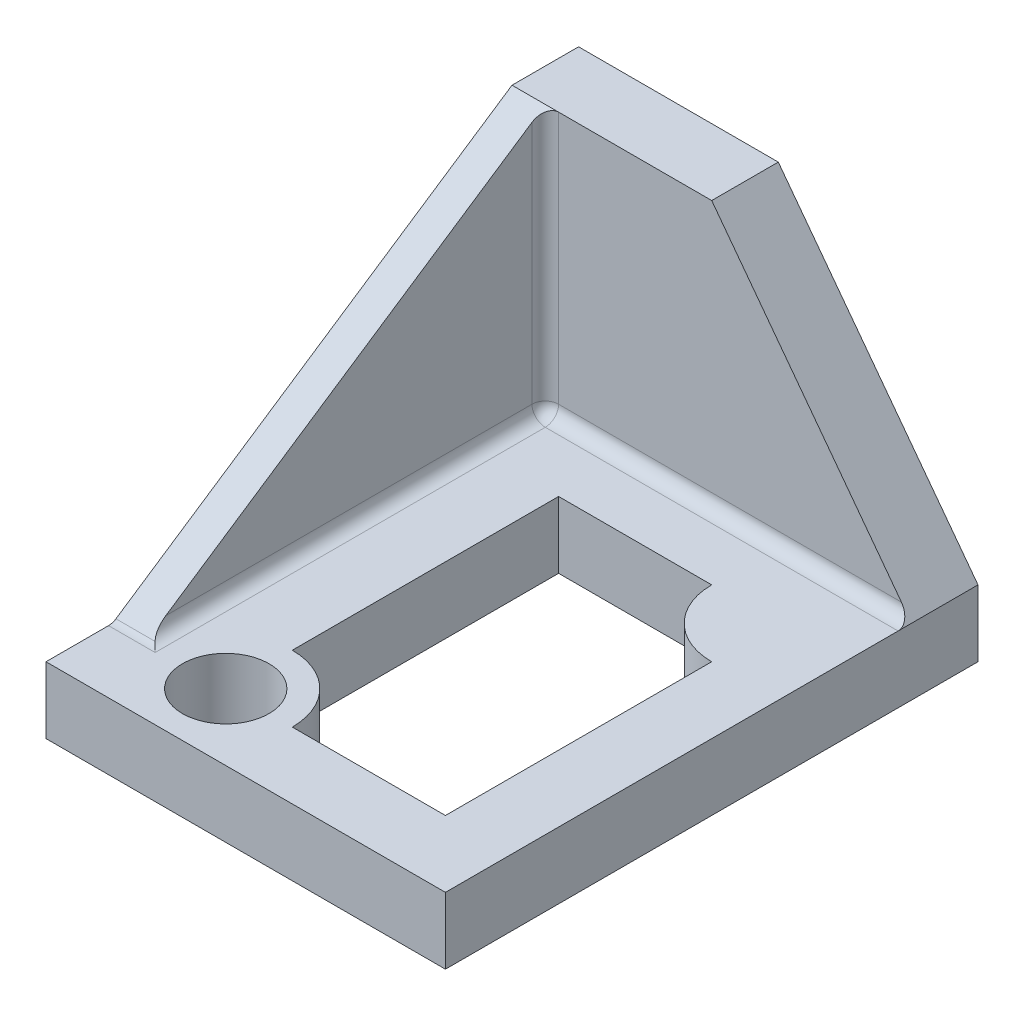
from build123d import *

# Parameters (mm, degrees)
SKETCH2_W          = 76.2
SKETCH2_H          = 12.7
EXTRUDE1_DEPTH     = 101.6
EXTRUDE2_DEPTH     = 6.35
EXTRUDE4_DEPTH     = 12.7
FILLET1_R          = 2.54
CUT_EXTRUDE1_DEPTH = 137.783186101
SKETCH11_R         = 8.255
CUT_EXTRUDE2_DEPTH = 137.783186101


with BuildPart() as part:
    # Sketch2 → Extrude1 (new body)
    with BuildSketch(Plane.XY):
        with Locations((38.1, -6.35)):
            Rectangle(SKETCH2_W, SKETCH2_H)
    extrude(amount=EXTRUDE1_DEPTH)

    # Sketch3 → Extrude2 (add)
    with BuildSketch(Plane.ZY):
        Polygon((0, 50.8), (12.7, 50.8), (88.9, 0), (0, 0), align=None)
    extrude(amount=-EXTRUDE2_DEPTH)

    # Sketch5 → Extrude4 (add)
    with BuildSketch(Plane(origin=(0, 0, 0), x_dir=(-1, 0, 0), z_dir=(0, 0, -1))):
        Polygon((-6.35, 50.8), (-38.1, 50.8), (-76.2, 0), (-6.35, 0), align=None)
    extrude(amount=-EXTRUDE4_DEPTH)

    # Fillet1
    fillet1_edges = [part.edges().sort_by_distance(p)[0] for p in [
        (3.175, 0, 88.9),
        (6.35, 0, 50.8),
        (41.275, 0, 12.7),
        (6.35, 25.4, 12.7),
    ]]
    fillet(fillet1_edges, radius=FILLET1_R)

    # Sketch9 → Cut-Extrude1 (cut, through all)
    with BuildSketch(Plane(origin=(0, 0, 0), x_dir=(-1, 0, 0), z_dir=(0, 1, 0))):
        with BuildLine():
            Line((-63.5, 88.9), (-63.5, 38.1))
            ThreePointArc((-63.5, 38.1), (-54.519743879, 34.380256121), (-50.8, 25.4))
            Line((-50.8, 25.4), (-21.59, 25.4))
            Line((-21.59, 25.4), (-21.59, 76.2))
            ThreePointArc((-21.59, 76.2), (-30.570256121, 79.919743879), (-34.29, 88.9))
            Line((-34.29, 88.9), (-63.5, 88.9))
        make_face()
    extrude(amount=-CUT_EXTRUDE1_DEPTH, mode=Mode.SUBTRACT)

    # Sketch11 → Cut-Extrude2 (cut, through all)
    with BuildSketch(Plane(origin=(0, 0, 0), x_dir=(-1, 0, 0), z_dir=(0, 1, 0))):
        with Locations(Location((-21.59, 88.9, 0), (0, 0, 90))):
            Circle(SKETCH11_R)
    extrude(amount=-CUT_EXTRUDE2_DEPTH, mode=Mode.SUBTRACT)


solid = part.part
